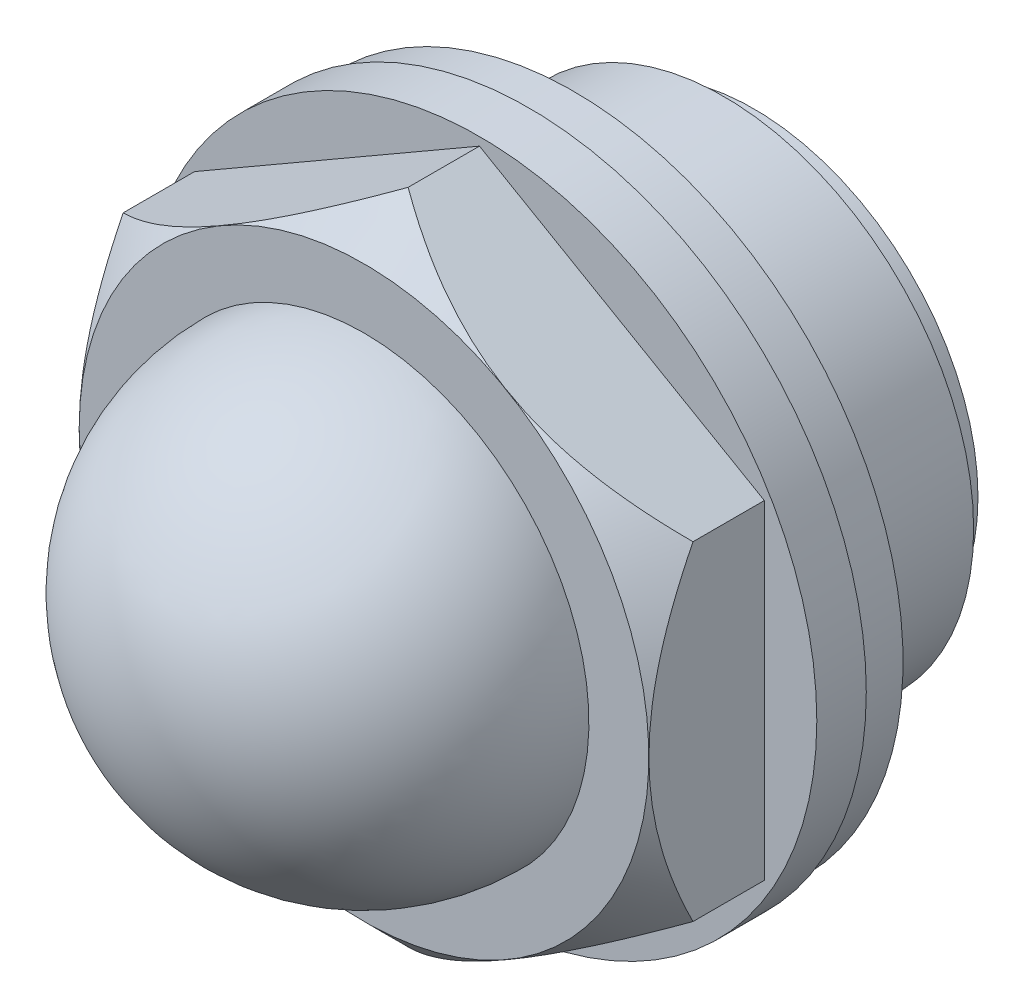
ISO-10303-21;
HEADER;
FILE_DESCRIPTION(('STEP AP214'),'2;1');
FILE_NAME('part.step','',(''),(''),'','','');
FILE_SCHEMA(('AUTOMOTIVE_DESIGN { 1 0 10303 214 1 1 1 1 }'));
ENDSEC;
DATA;
#1=APPLICATION_CONTEXT('core data for automotive mechanical design processes');
#2=APPLICATION_PROTOCOL_DEFINITION('international standard','automotive_design',2000,#1);
#3=PRODUCT_CONTEXT('',#1,'mechanical');
#4=PRODUCT('Part','Part','',(#3));
#5=PRODUCT_RELATED_PRODUCT_CATEGORY('part','',(#4));
#6=PRODUCT_DEFINITION_FORMATION('','',#4);
#7=PRODUCT_DEFINITION_CONTEXT('part definition',#1,'design');
#8=PRODUCT_DEFINITION('design','',#6,#7);
#9=PRODUCT_DEFINITION_SHAPE('','',#8);
#10=(LENGTH_UNIT() NAMED_UNIT(*) SI_UNIT(.MILLI.,.METRE.));
#11=(NAMED_UNIT(*) PLANE_ANGLE_UNIT() SI_UNIT($,.RADIAN.));
#12=(NAMED_UNIT(*) SI_UNIT($,.STERADIAN.) SOLID_ANGLE_UNIT());
#13=UNCERTAINTY_MEASURE_WITH_UNIT(LENGTH_MEASURE(1.E-05),#10,'distance_accuracy_value','');
#14=(GEOMETRIC_REPRESENTATION_CONTEXT(3) GLOBAL_UNCERTAINTY_ASSIGNED_CONTEXT((#13)) GLOBAL_UNIT_ASSIGNED_CONTEXT((#10,
#11,#12)) REPRESENTATION_CONTEXT('',''));
#15=CARTESIAN_POINT('',(0.,0.,0.));
#16=DIRECTION('',(0.,0.,1.));
#17=DIRECTION('',(1.,0.,0.));
#18=AXIS2_PLACEMENT_3D('',#15,#16,#17);
#19=CARTESIAN_POINT('',(0.,0.,14.5));
#20=DIRECTION('',(0.,0.,-1.));
#21=DIRECTION('',(-1.,0.,0.));
#22=AXIS2_PLACEMENT_3D('',#19,#20,#21);
#23=CYLINDRICAL_SURFACE('',#22,8.33);
#24=CARTESIAN_POINT('',(0.,0.,-5.));
#25=DIRECTION('',(0.,0.,-1.));
#26=DIRECTION('',(-1.,0.,0.));
#27=AXIS2_PLACEMENT_3D('',#24,#25,#26);
#28=CIRCLE('',#27,8.33);
#29=CARTESIAN_POINT('',(-8.33,0.,-5.));
#30=VERTEX_POINT('',#29);
#31=EDGE_CURVE('E196',#30,#30,#28,.T.);
#32=ORIENTED_EDGE('',*,*,#31,.F.);
#33=EDGE_LOOP('',(#32));
#34=FACE_BOUND('',#33,.T.);
#35=CARTESIAN_POINT('',(0.,0.,0.));
#36=DIRECTION('',(0.,0.,1.));
#37=DIRECTION('',(1.,0.,0.));
#38=AXIS2_PLACEMENT_3D('',#35,#36,#37);
#39=CIRCLE('',#38,8.33);
#40=CARTESIAN_POINT('',(8.33,0.,0.));
#41=VERTEX_POINT('',#40);
#42=EDGE_CURVE('E9',#41,#41,#39,.F.);
#43=ORIENTED_EDGE('',*,*,#42,.T.);
#44=EDGE_LOOP('',(#43));
#45=FACE_BOUND('',#44,.T.);
#46=ADVANCED_FACE('F14',(#34,#45),#23,.T.);
#47=CARTESIAN_POINT('',(0.,7.14706072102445E-13,7.0000000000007));
#48=DIRECTION('',(0.,0.,-1.));
#49=DIRECTION('',(0.,1.,0.));
#50=AXIS2_PLACEMENT_3D('',#47,#48,#49);
#51=SPHERICAL_SURFACE('',#50,5.9999999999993);
#52=CARTESIAN_POINT('',(0.,0.,7.361437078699));
#53=DIRECTION('',(0.,0.,-1.));
#54=DIRECTION('',(-1.,0.,0.));
#55=AXIS2_PLACEMENT_3D('',#52,#53,#54);
#56=CIRCLE('',#55,5.9891037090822);
#57=CARTESIAN_POINT('',(-5.9891037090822,0.,7.361437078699));
#58=VERTEX_POINT('',#57);
#59=EDGE_CURVE('E229',#58,#58,#56,.T.);
#60=ORIENTED_EDGE('',*,*,#59,.T.);
#61=EDGE_LOOP('',(#60));
#62=FACE_BOUND('',#61,.T.);
#63=ADVANCED_FACE('F16',(#62),#51,.F.);
#64=CARTESIAN_POINT('',(0.,0.,7.361437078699));
#65=DIRECTION('',(0.,0.,-1.));
#66=DIRECTION('',(-1.,0.,0.));
#67=AXIS2_PLACEMENT_3D('',#64,#65,#66);
#68=CONICAL_SURFACE('',#67,5.9891037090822,0.0602760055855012);
#69=CARTESIAN_POINT('',(0.,0.,-6.));
#70=DIRECTION('',(0.,0.,-1.));
#71=DIRECTION('',(-1.,0.,0.));
#72=AXIS2_PLACEMENT_3D('',#69,#70,#71);
#73=CIRCLE('',#72,6.7954545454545);
#74=CARTESIAN_POINT('',(-6.7954545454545,0.,-6.));
#75=VERTEX_POINT('',#74);
#76=EDGE_CURVE('E231',#75,#75,#73,.T.);
#77=ORIENTED_EDGE('',*,*,#76,.T.);
#78=EDGE_LOOP('',(#77));
#79=FACE_BOUND('',#78,.T.);
#80=ORIENTED_EDGE('',*,*,#59,.F.);
#81=EDGE_LOOP('',(#80));
#82=FACE_BOUND('',#81,.T.);
#83=ADVANCED_FACE('F191',(#79,#82),#68,.F.);
#84=CARTESIAN_POINT('',(0.,6.7954545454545,-6.));
#85=DIRECTION('',(0.,0.,-1.));
#86=DIRECTION('',(-1.,0.,0.));
#87=AXIS2_PLACEMENT_3D('',#84,#85,#86);
#88=PLANE('',#87);
#89=CARTESIAN_POINT('',(0.,0.,-6.));
#90=DIRECTION('',(0.,0.,-1.));
#91=DIRECTION('',(-1.,0.,0.));
#92=AXIS2_PLACEMENT_3D('',#89,#90,#91);
#93=CIRCLE('',#92,7.475);
#94=CARTESIAN_POINT('',(-7.475,0.,-6.));
#95=VERTEX_POINT('',#94);
#96=EDGE_CURVE('E234',#95,#95,#93,.T.);
#97=ORIENTED_EDGE('',*,*,#96,.T.);
#98=EDGE_LOOP('',(#97));
#99=FACE_BOUND('',#98,.T.);
#100=ORIENTED_EDGE('',*,*,#76,.F.);
#101=EDGE_LOOP('',(#100));
#102=FACE_BOUND('',#101,.T.);
#103=ADVANCED_FACE('F260',(#99,#102),#88,.T.);
#104=CARTESIAN_POINT('',(0.,0.,14.5));
#105=DIRECTION('',(0.,0.,-1.));
#106=DIRECTION('',(-1.,0.,0.));
#107=AXIS2_PLACEMENT_3D('',#104,#105,#106);
#108=CYLINDRICAL_SURFACE('',#107,7.475);
#109=CARTESIAN_POINT('',(0.,0.,-5.));
#110=DIRECTION('',(0.,0.,-1.));
#111=DIRECTION('',(-1.,0.,0.));
#112=AXIS2_PLACEMENT_3D('',#109,#110,#111);
#113=CIRCLE('',#112,7.475);
#114=CARTESIAN_POINT('',(-7.475,0.,-5.));
#115=VERTEX_POINT('',#114);
#116=EDGE_CURVE('E239',#115,#115,#113,.T.);
#117=ORIENTED_EDGE('',*,*,#116,.T.);
#118=EDGE_LOOP('',(#117));
#119=FACE_BOUND('',#118,.T.);
#120=ORIENTED_EDGE('',*,*,#96,.F.);
#121=EDGE_LOOP('',(#120));
#122=FACE_BOUND('',#121,.T.);
#123=ADVANCED_FACE('F255',(#119,#122),#108,.T.);
#124=CARTESIAN_POINT('',(0.,7.475,-5.));
#125=DIRECTION('',(0.,0.,-1.));
#126=DIRECTION('',(-1.,0.,0.));
#127=AXIS2_PLACEMENT_3D('',#124,#125,#126);
#128=PLANE('',#127);
#129=ORIENTED_EDGE('',*,*,#31,.T.);
#130=EDGE_LOOP('',(#129));
#131=FACE_BOUND('',#130,.T.);
#132=ORIENTED_EDGE('',*,*,#116,.F.);
#133=EDGE_LOOP('',(#132));
#134=FACE_BOUND('',#133,.T.);
#135=ADVANCED_FACE('F252',(#131,#134),#128,.T.);
#136=CARTESIAN_POINT('',(0.,7.3816799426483,3.15));
#137=DIRECTION('',(0.,0.,-1.));
#138=DIRECTION('',(-1.,0.,0.));
#139=AXIS2_PLACEMENT_3D('',#136,#137,#138);
#140=PLANE('',#139);
#141=CARTESIAN_POINT('',(0.,0.,3.15));
#142=DIRECTION('',(0.,0.,-1.));
#143=DIRECTION('',(-1.,0.,0.));
#144=AXIS2_PLACEMENT_3D('',#141,#142,#143);
#145=CIRCLE('',#144,11.25);
#146=CARTESIAN_POINT('',(-11.25,0.,3.15));
#147=VERTEX_POINT('',#146);
#148=EDGE_CURVE('E208',#147,#147,#145,.T.);
#149=ORIENTED_EDGE('',*,*,#148,.F.);
#150=EDGE_LOOP('',(#149));
#151=FACE_BOUND('',#150,.T.);
#152=DIRECTION('',(-0.866025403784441,-0.5,0.));
#153=VECTOR('',#152,1.);
#154=CARTESIAN_POINT('',(9.5,-5.4848275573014,3.15));
#155=LINE('',#154,#153);
#156=CARTESIAN_POINT('',(9.5,-5.4848275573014,3.15));
#157=VERTEX_POINT('',#156);
#158=CARTESIAN_POINT('',(0.,-10.9696551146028,3.15));
#159=VERTEX_POINT('',#158);
#160=EDGE_CURVE('E82',#157,#159,#155,.T.);
#161=ORIENTED_EDGE('',*,*,#160,.T.);
#162=DIRECTION('',(-0.866025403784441,0.5,0.));
#163=VECTOR('',#162,1.);
#164=CARTESIAN_POINT('',(13.908965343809,-19.,3.15));
#165=LINE('',#164,#163);
#166=CARTESIAN_POINT('',(-9.5,-5.4848275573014,3.15));
#167=VERTEX_POINT('',#166);
#168=EDGE_CURVE('E78',#159,#167,#165,.T.);
#169=ORIENTED_EDGE('',*,*,#168,.T.);
#170=DIRECTION('',(0.,1.,0.));
#171=VECTOR('',#170,1.);
#172=CARTESIAN_POINT('',(-9.5,-5.4848275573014,3.15));
#173=LINE('',#172,#171);
#174=CARTESIAN_POINT('',(-9.5,5.4848275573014,3.15));
#175=VERTEX_POINT('',#174);
#176=EDGE_CURVE('E29',#167,#175,#173,.T.);
#177=ORIENTED_EDGE('',*,*,#176,.T.);
#178=DIRECTION('',(0.866025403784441,0.5,0.));
#179=VECTOR('',#178,1.);
#180=CARTESIAN_POINT('',(-9.5,5.4848275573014,3.15));
#181=LINE('',#180,#179);
#182=CARTESIAN_POINT('',(0.,10.9696551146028,3.15));
#183=VERTEX_POINT('',#182);
#184=EDGE_CURVE('E37',#175,#183,#181,.T.);
#185=ORIENTED_EDGE('',*,*,#184,.T.);
#186=DIRECTION('',(0.866025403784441,-0.5,0.));
#187=VECTOR('',#186,1.);
#188=CARTESIAN_POINT('',(-13.908965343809,19.,3.15));
#189=LINE('',#188,#187);
#190=CARTESIAN_POINT('',(9.5,5.4848275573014,3.15));
#191=VERTEX_POINT('',#190);
#192=EDGE_CURVE('E87',#183,#191,#189,.T.);
#193=ORIENTED_EDGE('',*,*,#192,.T.);
#194=DIRECTION('',(0.,-1.,0.));
#195=VECTOR('',#194,1.);
#196=CARTESIAN_POINT('',(9.5,5.4848275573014,3.15));
#197=LINE('',#196,#195);
#198=EDGE_CURVE('E22',#191,#157,#197,.T.);
#199=ORIENTED_EDGE('',*,*,#198,.T.);
#200=EDGE_LOOP('',(#161,#169,#177,#185,#193,#199));
#201=FACE_BOUND('',#200,.T.);
#202=ADVANCED_FACE('F90',(#151,#201),#140,.F.);
#203=CARTESIAN_POINT('',(0.,0.,14.5));
#204=DIRECTION('',(0.,0.,-1.));
#205=DIRECTION('',(-1.,0.,0.));
#206=AXIS2_PLACEMENT_3D('',#203,#204,#205);
#207=CYLINDRICAL_SURFACE('',#206,10.975609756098);
#208=CARTESIAN_POINT('',(0.,0.,0.));
#209=DIRECTION('',(0.,0.,-1.));
#210=DIRECTION('',(-1.,0.,0.));
#211=AXIS2_PLACEMENT_3D('',#208,#209,#210);
#212=CIRCLE('',#211,10.975609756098);
#213=CARTESIAN_POINT('',(-10.975609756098,0.,0.));
#214=VERTEX_POINT('',#213);
#215=EDGE_CURVE('E206',#214,#214,#212,.T.);
#216=ORIENTED_EDGE('',*,*,#215,.F.);
#217=EDGE_LOOP('',(#216));
#218=FACE_BOUND('',#217,.T.);
#219=CARTESIAN_POINT('',(0.,0.,1.5));
#220=DIRECTION('',(0.,0.,-1.));
#221=DIRECTION('',(-1.,0.,0.));
#222=AXIS2_PLACEMENT_3D('',#219,#220,#221);
#223=CIRCLE('',#222,10.975609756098);
#224=CARTESIAN_POINT('',(-10.975609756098,0.,1.5));
#225=VERTEX_POINT('',#224);
#226=EDGE_CURVE('E596',#225,#225,#223,.T.);
#227=ORIENTED_EDGE('',*,*,#226,.T.);
#228=EDGE_LOOP('',(#227));
#229=FACE_BOUND('',#228,.T.);
#230=ADVANCED_FACE('F202',(#218,#229),#207,.T.);
#231=CARTESIAN_POINT('',(0.,10.975609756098,0.));
#232=DIRECTION('',(0.,0.,1.));
#233=DIRECTION('',(1.,0.,0.));
#234=AXIS2_PLACEMENT_3D('',#231,#232,#233);
#235=PLANE('',#234);
#236=ORIENTED_EDGE('',*,*,#42,.F.);
#237=EDGE_LOOP('',(#236));
#238=FACE_BOUND('',#237,.T.);
#239=ORIENTED_EDGE('',*,*,#215,.T.);
#240=EDGE_LOOP('',(#239));
#241=FACE_BOUND('',#240,.T.);
#242=ADVANCED_FACE('F199',(#238,#241),#235,.F.);
#243=CARTESIAN_POINT('',(0.,0.,14.5));
#244=DIRECTION('',(0.,0.,-1.));
#245=DIRECTION('',(-1.,0.,0.));
#246=AXIS2_PLACEMENT_3D('',#243,#244,#245);
#247=CYLINDRICAL_SURFACE('',#246,11.25);
#248=CARTESIAN_POINT('',(0.,0.,1.5));
#249=DIRECTION('',(0.,0.,-1.));
#250=DIRECTION('',(-1.,0.,0.));
#251=AXIS2_PLACEMENT_3D('',#248,#249,#250);
#252=CIRCLE('',#251,11.25);
#253=CARTESIAN_POINT('',(-11.25,0.,1.5));
#254=VERTEX_POINT('',#253);
#255=EDGE_CURVE('E212',#254,#254,#252,.T.);
#256=ORIENTED_EDGE('',*,*,#255,.F.);
#257=EDGE_LOOP('',(#256));
#258=FACE_BOUND('',#257,.T.);
#259=ORIENTED_EDGE('',*,*,#148,.T.);
#260=EDGE_LOOP('',(#259));
#261=FACE_BOUND('',#260,.T.);
#262=ADVANCED_FACE('F181',(#258,#261),#247,.T.);
#263=CARTESIAN_POINT('',(0.,11.25,1.5));
#264=DIRECTION('',(0.,0.,1.));
#265=DIRECTION('',(1.,0.,0.));
#266=AXIS2_PLACEMENT_3D('',#263,#264,#265);
#267=PLANE('',#266);
#268=ORIENTED_EDGE('',*,*,#226,.F.);
#269=EDGE_LOOP('',(#268));
#270=FACE_BOUND('',#269,.T.);
#271=ORIENTED_EDGE('',*,*,#255,.T.);
#272=EDGE_LOOP('',(#271));
#273=FACE_BOUND('',#272,.T.);
#274=ADVANCED_FACE('F172',(#270,#273),#267,.F.);
#275=CARTESIAN_POINT('',(0.,-1.91253263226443E-13,6.9999999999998));
#276=DIRECTION('',(0.,0.,-1.));
#277=DIRECTION('',(0.,1.,0.));
#278=AXIS2_PLACEMENT_3D('',#275,#276,#277);
#279=SPHERICAL_SURFACE('',#278,7.50000000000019);
#280=CARTESIAN_POINT('',(0.,0.,7.));
#281=DIRECTION('',(0.,0.,-1.));
#282=DIRECTION('',(-1.,0.,0.));
#283=AXIS2_PLACEMENT_3D('',#280,#281,#282);
#284=CIRCLE('',#283,7.5);
#285=CARTESIAN_POINT('',(-7.5,0.,7.));
#286=VERTEX_POINT('',#285);
#287=EDGE_CURVE('E246',#286,#286,#284,.T.);
#288=ORIENTED_EDGE('',*,*,#287,.F.);
#289=EDGE_LOOP('',(#288));
#290=FACE_BOUND('',#289,.T.);
#291=ADVANCED_FACE('F170',(#290),#279,.T.);
#292=CARTESIAN_POINT('',(0.,9.499,7.));
#293=DIRECTION('',(0.,0.,1.));
#294=DIRECTION('',(1.,0.,0.));
#295=AXIS2_PLACEMENT_3D('',#292,#293,#294);
#296=PLANE('',#295);
#297=ORIENTED_EDGE('',*,*,#287,.T.);
#298=EDGE_LOOP('',(#297));
#299=FACE_BOUND('',#298,.T.);
#300=CARTESIAN_POINT('',(0.,0.,7.));
#301=DIRECTION('',(0.,0.,-1.));
#302=DIRECTION('',(-1.,0.,0.));
#303=AXIS2_PLACEMENT_3D('',#300,#301,#302);
#304=CIRCLE('',#303,9.499);
#305=CARTESIAN_POINT('',(-9.499,0.,7.));
#306=VERTEX_POINT('',#305);
#307=EDGE_CURVE('E243',#306,#306,#304,.T.);
#308=ORIENTED_EDGE('',*,*,#307,.F.);
#309=EDGE_LOOP('',(#308));
#310=FACE_BOUND('',#309,.T.);
#311=ADVANCED_FACE('F108',(#299,#310),#296,.T.);
#312=CARTESIAN_POINT('',(0.,0.,5.249));
#313=DIRECTION('',(0.,0.,-1.));
#314=DIRECTION('',(-1.,0.,0.));
#315=AXIS2_PLACEMENT_3D('',#312,#313,#314);
#316=CONICAL_SURFACE('',#315,11.25,0.785398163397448);
#317=CARTESIAN_POINT('',(9.5002,-5.48471208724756,5.5292294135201));
#318=CARTESIAN_POINT('',(9.3366791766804,-5.57912087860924,5.62362483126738));
#319=CARTESIAN_POINT('',(9.17187614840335,-5.67426995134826,5.71513650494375));
#320=CARTESIAN_POINT('',(8.83950563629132,-5.86616415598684,5.89147520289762));
#321=CARTESIAN_POINT('',(8.67193669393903,-5.96291012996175,5.97629855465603));
#322=CARTESIAN_POINT('',(8.33304658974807,-6.1585684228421,6.13870122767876));
#323=CARTESIAN_POINT('',(8.16170945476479,-6.25748996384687,6.21623636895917));
#324=CARTESIAN_POINT('',(7.81621809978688,-6.45695949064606,6.36237593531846));
#325=CARTESIAN_POINT('',(7.64206431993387,-6.55750722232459,6.4309817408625));
#326=CARTESIAN_POINT('',(7.29415157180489,-6.75837474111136,6.55693966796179));
#327=CARTESIAN_POINT('',(7.12044180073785,-6.85866612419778,6.61447194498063));
#328=CARTESIAN_POINT('',(6.7705913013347,-7.06065240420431,6.71862965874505));
#329=CARTESIAN_POINT('',(6.59445083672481,-7.16234714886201,6.76525626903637));
#330=CARTESIAN_POINT('',(6.24049080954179,-7.3667060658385,6.84643118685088));
#331=CARTESIAN_POINT('',(6.06267595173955,-7.46936752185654,6.88100660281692));
#332=CARTESIAN_POINT('',(5.70555594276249,-7.67555085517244,6.93732096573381));
#333=CARTESIAN_POINT('',(5.52625101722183,-7.77907260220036,6.95906182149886));
#334=CARTESIAN_POINT('',(5.08914845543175,-8.03143388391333,6.99554144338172));
#335=CARTESIAN_POINT('',(4.83087795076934,-8.18054642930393,7.00320692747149));
#336=CARTESIAN_POINT('',(4.3148046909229,-8.47850146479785,6.99038864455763));
#337=CARTESIAN_POINT('',(4.05700212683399,-8.62734384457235,6.9698952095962));
#338=CARTESIAN_POINT('',(3.54351262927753,-8.92380714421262,6.90192574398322));
#339=CARTESIAN_POINT('',(3.28783199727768,-9.07142442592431,6.85438717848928));
#340=CARTESIAN_POINT('',(2.78086867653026,-9.36411983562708,6.73489261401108));
#341=CARTESIAN_POINT('',(2.52958574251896,-9.50919810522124,6.66293798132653));
#342=CARTESIAN_POINT('',(2.04118470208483,-9.79117657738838,6.50084121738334));
#343=CARTESIAN_POINT('',(1.80388054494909,-9.92818419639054,6.41143619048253));
#344=CARTESIAN_POINT('',(1.33443818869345,-10.1992168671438,6.21596445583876));
#345=CARTESIAN_POINT('',(1.1023016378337,-10.3332409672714,6.1098925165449));
#346=CARTESIAN_POINT('',(0.64408551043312,-10.5977921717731,5.88434552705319));
#347=CARTESIAN_POINT('',(0.417985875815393,-10.7283308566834,5.76492425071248));
#348=CARTESIAN_POINT('',(-0.0291395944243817,-10.9864788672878,5.51478479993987));
#349=CARTESIAN_POINT('',(-0.250171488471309,-11.1140916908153,5.38408111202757));
#350=CARTESIAN_POINT('',(-0.468979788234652,-11.2404207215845,5.2488));
#351=B_SPLINE_CURVE_WITH_KNOTS('',3,(#317,#318,#319,#320,#321,#322,#323,#324,#325,#326,#327,
#328,#329,#330,#331,#332,#333,#334,#335,#336,#337,#338,#339,#340,#341,#342,#343,#344,#345,#346,
#347,#348,#349,#350),.UNSPECIFIED.,.F.,.F.,(4,2,2,2,2,2,2,2,2,2,2,2,2,2,2,2,4),(0.,
0.633322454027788,1.26699027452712,1.90428027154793,2.54147162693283,3.16720677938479,
3.79287456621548,4.4171257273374,5.04128402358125,5.93486112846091,6.82874510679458,
7.72470440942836,8.62061358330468,9.48468847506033,10.3490351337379,11.2100176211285,
12.0699106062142),.UNSPECIFIED.);
#352=CARTESIAN_POINT('',(9.5,-5.4848275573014,5.52934488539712));
#353=VERTEX_POINT('',#352);
#354=CARTESIAN_POINT('',(0.,-10.9696551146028,5.52934488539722));
#355=VERTEX_POINT('',#354);
#356=EDGE_CURVE('E147',#353,#355,#351,.T.);
#357=ORIENTED_EDGE('',*,*,#356,.F.);
#358=CARTESIAN_POINT('',(9.5,-11.5594634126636,1.53667416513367));
#359=CARTESIAN_POINT('',(9.5,-11.2806225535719,1.75205038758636));
#360=CARTESIAN_POINT('',(9.5,-11.0002921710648,1.96552824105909));
#361=CARTESIAN_POINT('',(9.5,-10.4360389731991,2.38781618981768));
#362=CARTESIAN_POINT('',(9.5,-10.1521153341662,2.59662518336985));
#363=CARTESIAN_POINT('',(9.5,-9.57798890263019,3.01018988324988));
#364=CARTESIAN_POINT('',(9.5,-9.28775458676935,3.21490196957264));
#365=CARTESIAN_POINT('',(9.5,-8.70247807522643,3.61730984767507));
#366=CARTESIAN_POINT('',(9.5,-8.40743621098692,3.81500612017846));
#367=CARTESIAN_POINT('',(9.5,-7.79241989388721,4.21431114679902));
#368=CARTESIAN_POINT('',(9.5,-7.47206893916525,4.41534290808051));
#369=CARTESIAN_POINT('',(9.5,-6.82383713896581,4.80508508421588));
#370=CARTESIAN_POINT('',(9.5,-6.49595502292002,4.99379339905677));
#371=CARTESIAN_POINT('',(9.5,-5.83254499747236,5.35488183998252));
#372=CARTESIAN_POINT('',(9.5,-5.49704336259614,5.52730986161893));
#373=CARTESIAN_POINT('',(9.5,-4.81648567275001,5.85197414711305));
#374=CARTESIAN_POINT('',(9.5,-4.47143425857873,6.00422001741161));
#375=CARTESIAN_POINT('',(9.5,-3.80685063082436,6.26870096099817));
#376=CARTESIAN_POINT('',(9.5,-3.48832382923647,6.38343681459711));
#377=CARTESIAN_POINT('',(9.5,-2.84305846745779,6.58742155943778));
#378=CARTESIAN_POINT('',(9.5,-2.51631939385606,6.67666885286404));
#379=CARTESIAN_POINT('',(9.5,-1.86233019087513,6.82331770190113));
#380=CARTESIAN_POINT('',(9.5,-1.53521367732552,6.88130504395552));
#381=CARTESIAN_POINT('',(9.5,-0.876792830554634,6.96420751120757));
#382=CARTESIAN_POINT('',(9.5,-0.545489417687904,6.98912978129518));
#383=CARTESIAN_POINT('',(9.5,0.102815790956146,7.00371996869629));
#384=CARTESIAN_POINT('',(9.5,0.4197829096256,6.99493936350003));
#385=CARTESIAN_POINT('',(9.5,1.05129393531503,6.94619659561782));
#386=CARTESIAN_POINT('',(9.5,1.36583762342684,6.9062316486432));
#387=CARTESIAN_POINT('',(9.5,1.99556022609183,6.79671819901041));
#388=CARTESIAN_POINT('',(9.5,2.31064598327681,6.72664313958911));
#389=CARTESIAN_POINT('',(9.5,2.93386009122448,6.56083063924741));
#390=CARTESIAN_POINT('',(9.5,3.24198879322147,6.46509449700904));
#391=CARTESIAN_POINT('',(9.5,3.86608169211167,6.24684006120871));
#392=CARTESIAN_POINT('',(9.5,4.18165302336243,6.12321140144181));
#393=CARTESIAN_POINT('',(9.5,4.80469185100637,5.85683450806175));
#394=CARTESIAN_POINT('',(9.5,5.11215564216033,5.71407770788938));
#395=CARTESIAN_POINT('',(9.5,5.72042239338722,5.41282844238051));
#396=CARTESIAN_POINT('',(9.5,6.02120124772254,5.25428769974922));
#397=CARTESIAN_POINT('',(9.5,6.6158717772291,4.92495653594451));
#398=CARTESIAN_POINT('',(9.5,6.9097644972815,4.75416798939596));
#399=CARTESIAN_POINT('',(9.5,7.47721105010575,4.41139754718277));
#400=CARTESIAN_POINT('',(9.5,7.75105302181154,4.23989013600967));
#401=CARTESIAN_POINT('',(9.5,8.29403169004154,3.88956058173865));
#402=CARTESIAN_POINT('',(9.5,8.56316803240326,3.71073789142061));
#403=CARTESIAN_POINT('',(9.5,9.09519086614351,3.34853358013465));
#404=CARTESIAN_POINT('',(9.5,9.35811015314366,3.16519995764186));
#405=CARTESIAN_POINT('',(9.5,9.88033963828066,2.79360718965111));
#406=CARTESIAN_POINT('',(9.5,10.1396508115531,2.60534941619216));
#407=CARTESIAN_POINT('',(9.5,10.397447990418,2.41507566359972));
#408=B_SPLINE_CURVE_WITH_KNOTS('',3,(#358,#359,#360,#361,#362,#363,#364,#365,#366,#367,#368,
#369,#370,#371,#372,#373,#374,#375,#376,#377,#378,#379,#380,#381,#382,#383,#384,#385,#386,#387,
#388,#389,#390,#391,#392,#393,#394,#395,#396,#397,#398,#399,#400,#401,#402,#403,#404,#405,#406,
#407),.UNSPECIFIED.,.F.,.F.,(4,2,2,2,2,2,2,2,2,2,2,2,2,2,2,2,2,2,2,2,2,2,2,2,4),(0.,
1.05702061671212,2.114288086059,3.17970079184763,4.24504035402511,5.37943291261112,
6.51401827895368,7.64515436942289,8.77575010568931,9.79056152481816,10.805436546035,
11.8005669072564,12.7954821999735,13.7451590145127,14.694920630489,15.6620143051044,
16.6290590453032,17.6450536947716,18.6615048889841,19.6811665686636,20.7006725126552,
21.6698855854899,22.6391712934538,23.6006919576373,24.5619475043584),.UNSPECIFIED.);
#409=CARTESIAN_POINT('',(9.5,5.4848275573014,5.52934488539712));
#410=VERTEX_POINT('',#409);
#411=EDGE_CURVE('E73',#410,#353,#408,.F.);
#412=ORIENTED_EDGE('',*,*,#411,.F.);
#413=CARTESIAN_POINT('',(-0.46897978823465,11.2404207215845,5.2488));
#414=CARTESIAN_POINT('',(-0.324026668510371,11.1567319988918,5.33844670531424));
#415=CARTESIAN_POINT('',(-0.178109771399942,11.0724868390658,5.4260492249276));
#416=CARTESIAN_POINT('',(0.115810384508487,10.9027919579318,5.59658367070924));
#417=CARTESIAN_POINT('',(0.263814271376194,10.8173418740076,5.67951415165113));
#418=CARTESIAN_POINT('',(0.562621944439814,10.6448251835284,5.8404130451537));
#419=CARTESIAN_POINT('',(0.713435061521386,10.557753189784,5.91835848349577));
#420=CARTESIAN_POINT('',(1.01728930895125,10.382322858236,6.06816389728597));
#421=CARTESIAN_POINT('',(1.17033025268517,10.2939646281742,6.14002437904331));
#422=CARTESIAN_POINT('',(1.63170369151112,10.0275905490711,6.34479989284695));
#423=CARTESIAN_POINT('',(1.94350383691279,9.84757265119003,6.46757699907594));
#424=CARTESIAN_POINT('',(2.5752070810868,9.48285861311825,6.67886589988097));
#425=CARTESIAN_POINT('',(2.89509271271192,9.29817255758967,6.76744578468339));
#426=CARTESIAN_POINT('',(3.46088746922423,8.97151080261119,6.88704024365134));
#427=CARTESIAN_POINT('',(3.70539366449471,8.83034508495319,6.92689493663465));
#428=CARTESIAN_POINT('',(4.1965623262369,8.54676872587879,6.98171028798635));
#429=CARTESIAN_POINT('',(4.44322502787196,8.40435794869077,6.99666819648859));
#430=CARTESIAN_POINT('',(4.93646277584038,8.11958700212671,7.00082391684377));
#431=CARTESIAN_POINT('',(5.18303765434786,7.977226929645,6.99004802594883));
#432=CARTESIAN_POINT('',(5.67433858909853,7.69357420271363,6.94341350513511));
#433=CARTESIAN_POINT('',(5.91906483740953,7.55228143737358,6.90755751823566));
#434=CARTESIAN_POINT('',(6.45239051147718,7.2443657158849,6.80337978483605));
#435=CARTESIAN_POINT('',(6.74026015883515,7.07816409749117,6.73009806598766));
#436=CARTESIAN_POINT('',(7.30959613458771,6.74945781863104,6.55492171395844));
#437=CARTESIAN_POINT('',(7.59105490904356,6.5869575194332,6.45299504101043));
#438=CARTESIAN_POINT('',(8.14843336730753,6.26515491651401,6.22486025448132));
#439=CARTESIAN_POINT('',(8.42430634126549,6.10587958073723,6.09850159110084));
#440=CARTESIAN_POINT('',(8.83224174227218,5.87035796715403,5.8947725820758));
#441=CARTESIAN_POINT('',(8.96705860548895,5.79252141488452,5.82460465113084));
#442=CARTESIAN_POINT('',(9.23492388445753,5.63786932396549,5.68000103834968));
#443=CARTESIAN_POINT('',(9.36797275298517,5.56105352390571,5.60556647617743));
#444=CARTESIAN_POINT('',(9.5002,5.48471208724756,5.5292294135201));
#445=B_SPLINE_CURVE_WITH_KNOTS('',3,(#413,#414,#415,#416,#417,#418,#419,#420,#421,#422,#423,
#424,#425,#426,#427,#428,#429,#430,#431,#432,#433,#434,#435,#436,#437,#438,#439,#440,#441,#442,
#443,#444),.UNSPECIFIED.,.F.,.F.,(4,2,2,2,2,2,2,2,2,2,2,2,2,2,2,4),(0.,0.569627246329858,
1.13942974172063,1.71169282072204,2.28390823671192,3.42368220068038,4.56117490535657,
5.41556728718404,6.2700540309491,7.12366795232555,7.97719193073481,8.99681036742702,
10.0175738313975,11.0448401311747,11.5570570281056,12.069140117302),.UNSPECIFIED.);
#446=CARTESIAN_POINT('',(0.,10.9696551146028,5.52934488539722));
#447=VERTEX_POINT('',#446);
#448=EDGE_CURVE('E140',#447,#410,#445,.T.);
#449=ORIENTED_EDGE('',*,*,#448,.F.);
#450=CARTESIAN_POINT('',(-9.5002,5.48471208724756,5.5292294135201));
#451=CARTESIAN_POINT('',(-9.3366791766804,5.57912087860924,5.62362483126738));
#452=CARTESIAN_POINT('',(-9.17187614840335,5.67426995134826,5.71513650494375));
#453=CARTESIAN_POINT('',(-8.83950563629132,5.86616415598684,5.89147520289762));
#454=CARTESIAN_POINT('',(-8.67193669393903,5.96291012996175,5.97629855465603));
#455=CARTESIAN_POINT('',(-8.33304658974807,6.1585684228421,6.13870122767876));
#456=CARTESIAN_POINT('',(-8.16170945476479,6.25748996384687,6.21623636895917));
#457=CARTESIAN_POINT('',(-7.81621809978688,6.45695949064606,6.36237593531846));
#458=CARTESIAN_POINT('',(-7.64206431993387,6.55750722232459,6.4309817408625));
#459=CARTESIAN_POINT('',(-7.29415157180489,6.75837474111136,6.55693966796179));
#460=CARTESIAN_POINT('',(-7.12044180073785,6.85866612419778,6.61447194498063));
#461=CARTESIAN_POINT('',(-6.7705913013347,7.06065240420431,6.71862965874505));
#462=CARTESIAN_POINT('',(-6.59445083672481,7.16234714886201,6.76525626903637));
#463=CARTESIAN_POINT('',(-6.24049080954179,7.3667060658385,6.84643118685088));
#464=CARTESIAN_POINT('',(-6.06267595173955,7.46936752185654,6.88100660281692));
#465=CARTESIAN_POINT('',(-5.70555594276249,7.67555085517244,6.93732096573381));
#466=CARTESIAN_POINT('',(-5.52625101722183,7.77907260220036,6.95906182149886));
#467=CARTESIAN_POINT('',(-5.08914845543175,8.03143388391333,6.99554144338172));
#468=CARTESIAN_POINT('',(-4.83087795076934,8.18054642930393,7.00320692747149));
#469=CARTESIAN_POINT('',(-4.3148046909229,8.47850146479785,6.99038864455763));
#470=CARTESIAN_POINT('',(-4.05700212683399,8.62734384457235,6.9698952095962));
#471=CARTESIAN_POINT('',(-3.54351262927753,8.92380714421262,6.90192574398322));
#472=CARTESIAN_POINT('',(-3.28783199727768,9.07142442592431,6.85438717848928));
#473=CARTESIAN_POINT('',(-2.78086867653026,9.36411983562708,6.73489261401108));
#474=CARTESIAN_POINT('',(-2.52958574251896,9.50919810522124,6.66293798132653));
#475=CARTESIAN_POINT('',(-2.04118470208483,9.79117657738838,6.50084121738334));
#476=CARTESIAN_POINT('',(-1.80388054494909,9.92818419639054,6.41143619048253));
#477=CARTESIAN_POINT('',(-1.33443818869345,10.1992168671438,6.21596445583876));
#478=CARTESIAN_POINT('',(-1.1023016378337,10.3332409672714,6.1098925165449));
#479=CARTESIAN_POINT('',(-0.64408551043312,10.5977921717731,5.88434552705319));
#480=CARTESIAN_POINT('',(-0.417985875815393,10.7283308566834,5.76492425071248));
#481=CARTESIAN_POINT('',(0.0291395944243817,10.9864788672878,5.51478479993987));
#482=CARTESIAN_POINT('',(0.250171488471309,11.1140916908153,5.38408111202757));
#483=CARTESIAN_POINT('',(0.468979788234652,11.2404207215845,5.2488));
#484=B_SPLINE_CURVE_WITH_KNOTS('',3,(#450,#451,#452,#453,#454,#455,#456,#457,#458,#459,#460,
#461,#462,#463,#464,#465,#466,#467,#468,#469,#470,#471,#472,#473,#474,#475,#476,#477,#478,#479,
#480,#481,#482,#483),.UNSPECIFIED.,.F.,.F.,(4,2,2,2,2,2,2,2,2,2,2,2,2,2,2,2,4),(0.,
0.633322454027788,1.26699027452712,1.90428027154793,2.54147162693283,3.16720677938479,
3.79287456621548,4.4171257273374,5.04128402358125,5.93486112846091,6.82874510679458,
7.72470440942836,8.62061358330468,9.48468847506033,10.3490351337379,11.2100176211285,
12.0699106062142),.UNSPECIFIED.);
#485=CARTESIAN_POINT('',(-9.5,5.4848275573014,5.52934488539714));
#486=VERTEX_POINT('',#485);
#487=EDGE_CURVE('E115',#486,#447,#484,.T.);
#488=ORIENTED_EDGE('',*,*,#487,.F.);
#489=CARTESIAN_POINT('',(-9.5,-11.5594634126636,1.53667416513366));
#490=CARTESIAN_POINT('',(-9.5,-11.2806225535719,1.75205038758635));
#491=CARTESIAN_POINT('',(-9.5,-11.0002921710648,1.96552824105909));
#492=CARTESIAN_POINT('',(-9.5,-10.4360389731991,2.38781618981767));
#493=CARTESIAN_POINT('',(-9.5,-10.1521153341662,2.59662518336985));
#494=CARTESIAN_POINT('',(-9.5,-9.57798890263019,3.01018988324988));
#495=CARTESIAN_POINT('',(-9.5,-9.28775458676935,3.21490196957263));
#496=CARTESIAN_POINT('',(-9.5,-8.70247807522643,3.61730984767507));
#497=CARTESIAN_POINT('',(-9.5,-8.40743621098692,3.81500612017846));
#498=CARTESIAN_POINT('',(-9.5,-7.79241989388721,4.21431114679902));
#499=CARTESIAN_POINT('',(-9.5,-7.47206893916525,4.41534290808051));
#500=CARTESIAN_POINT('',(-9.5,-6.82383713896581,4.80508508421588));
#501=CARTESIAN_POINT('',(-9.5,-6.49595502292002,4.99379339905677));
#502=CARTESIAN_POINT('',(-9.5,-5.83254499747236,5.35488183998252));
#503=CARTESIAN_POINT('',(-9.5,-5.49704336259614,5.52730986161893));
#504=CARTESIAN_POINT('',(-9.5,-4.81648567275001,5.85197414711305));
#505=CARTESIAN_POINT('',(-9.5,-4.47143425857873,6.00422001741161));
#506=CARTESIAN_POINT('',(-9.5,-3.80685063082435,6.26870096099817));
#507=CARTESIAN_POINT('',(-9.5,-3.48832382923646,6.38343681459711));
#508=CARTESIAN_POINT('',(-9.5,-2.84305846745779,6.58742155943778));
#509=CARTESIAN_POINT('',(-9.5,-2.51631939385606,6.67666885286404));
#510=CARTESIAN_POINT('',(-9.5,-1.86233019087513,6.82331770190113));
#511=CARTESIAN_POINT('',(-9.5,-1.53521367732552,6.88130504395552));
#512=CARTESIAN_POINT('',(-9.5,-0.876792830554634,6.96420751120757));
#513=CARTESIAN_POINT('',(-9.5,-0.545489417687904,6.98912978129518));
#514=CARTESIAN_POINT('',(-9.5,0.102815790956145,7.00371996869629));
#515=CARTESIAN_POINT('',(-9.5,0.419782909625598,6.99493936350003));
#516=CARTESIAN_POINT('',(-9.5,1.05129393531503,6.94619659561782));
#517=CARTESIAN_POINT('',(-9.5,1.36583762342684,6.9062316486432));
#518=CARTESIAN_POINT('',(-9.5,1.99556022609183,6.79671819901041));
#519=CARTESIAN_POINT('',(-9.5,2.3106459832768,6.72664313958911));
#520=CARTESIAN_POINT('',(-9.5,2.93386009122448,6.56083063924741));
#521=CARTESIAN_POINT('',(-9.5,3.24198879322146,6.46509449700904));
#522=CARTESIAN_POINT('',(-9.5,3.86608169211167,6.24684006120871));
#523=CARTESIAN_POINT('',(-9.5,4.18165302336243,6.12321140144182));
#524=CARTESIAN_POINT('',(-9.5,4.80469185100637,5.85683450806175));
#525=CARTESIAN_POINT('',(-9.5,5.11215564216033,5.71407770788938));
#526=CARTESIAN_POINT('',(-9.5,5.72042239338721,5.41282844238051));
#527=CARTESIAN_POINT('',(-9.5,6.02120124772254,5.25428769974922));
#528=CARTESIAN_POINT('',(-9.5,6.6158717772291,4.92495653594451));
#529=CARTESIAN_POINT('',(-9.5,6.9097644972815,4.75416798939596));
#530=CARTESIAN_POINT('',(-9.5,7.47721105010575,4.41139754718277));
#531=CARTESIAN_POINT('',(-9.5,7.75105302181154,4.23989013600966));
#532=CARTESIAN_POINT('',(-9.5,8.29403169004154,3.88956058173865));
#533=CARTESIAN_POINT('',(-9.5,8.56316803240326,3.71073789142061));
#534=CARTESIAN_POINT('',(-9.5,9.09519086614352,3.34853358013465));
#535=CARTESIAN_POINT('',(-9.5,9.35811015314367,3.16519995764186));
#536=CARTESIAN_POINT('',(-9.5,9.88033963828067,2.79360718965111));
#537=CARTESIAN_POINT('',(-9.5,10.1396508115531,2.60534941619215));
#538=CARTESIAN_POINT('',(-9.5,10.397447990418,2.41507566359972));
#539=B_SPLINE_CURVE_WITH_KNOTS('',3,(#489,#490,#491,#492,#493,#494,#495,#496,#497,#498,#499,
#500,#501,#502,#503,#504,#505,#506,#507,#508,#509,#510,#511,#512,#513,#514,#515,#516,#517,#518,
#519,#520,#521,#522,#523,#524,#525,#526,#527,#528,#529,#530,#531,#532,#533,#534,#535,#536,#537,
#538),.UNSPECIFIED.,.F.,.F.,(4,2,2,2,2,2,2,2,2,2,2,2,2,2,2,2,2,2,2,2,2,2,2,2,4),(0.,
1.05702061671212,2.114288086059,3.17970079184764,4.24504035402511,5.37943291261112,
6.51401827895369,7.6451543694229,8.77575010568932,9.79056152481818,10.8054365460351,
11.8005669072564,12.7954821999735,13.7451590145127,14.694920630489,15.6620143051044,
16.6290590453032,17.6450536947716,18.6615048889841,19.6811665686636,20.7006725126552,
21.6698855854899,22.6391712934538,23.6006919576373,24.5619475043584),.UNSPECIFIED.);
#540=CARTESIAN_POINT('',(-9.5,-5.4848275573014,5.52934488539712));
#541=VERTEX_POINT('',#540);
#542=EDGE_CURVE('E125',#541,#486,#539,.T.);
#543=ORIENTED_EDGE('',*,*,#542,.F.);
#544=CARTESIAN_POINT('',(0.468979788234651,-11.2404207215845,5.2488));
#545=CARTESIAN_POINT('',(0.324026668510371,-11.1567319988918,5.33844670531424));
#546=CARTESIAN_POINT('',(0.178109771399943,-11.0724868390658,5.4260492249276));
#547=CARTESIAN_POINT('',(-0.115810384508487,-10.9027919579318,5.59658367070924));
#548=CARTESIAN_POINT('',(-0.263814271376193,-10.8173418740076,5.67951415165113));
#549=CARTESIAN_POINT('',(-0.562621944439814,-10.6448251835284,5.8404130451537));
#550=CARTESIAN_POINT('',(-0.713435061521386,-10.557753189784,5.91835848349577));
#551=CARTESIAN_POINT('',(-1.01728930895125,-10.382322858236,6.06816389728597));
#552=CARTESIAN_POINT('',(-1.17033025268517,-10.2939646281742,6.14002437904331));
#553=CARTESIAN_POINT('',(-1.63170369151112,-10.0275905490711,6.34479989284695));
#554=CARTESIAN_POINT('',(-1.94350383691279,-9.84757265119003,6.46757699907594));
#555=CARTESIAN_POINT('',(-2.5752070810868,-9.48285861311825,6.67886589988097));
#556=CARTESIAN_POINT('',(-2.89509271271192,-9.29817255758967,6.76744578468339));
#557=CARTESIAN_POINT('',(-3.46088746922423,-8.97151080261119,6.88704024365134));
#558=CARTESIAN_POINT('',(-3.70539366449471,-8.83034508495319,6.92689493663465));
#559=CARTESIAN_POINT('',(-4.1965623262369,-8.54676872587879,6.98171028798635));
#560=CARTESIAN_POINT('',(-4.44322502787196,-8.40435794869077,6.99666819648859));
#561=CARTESIAN_POINT('',(-4.93646277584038,-8.11958700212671,7.00082391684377));
#562=CARTESIAN_POINT('',(-5.18303765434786,-7.977226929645,6.99004802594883));
#563=CARTESIAN_POINT('',(-5.67433858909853,-7.69357420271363,6.94341350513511));
#564=CARTESIAN_POINT('',(-5.91906483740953,-7.55228143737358,6.90755751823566));
#565=CARTESIAN_POINT('',(-6.45239051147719,-7.2443657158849,6.80337978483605));
#566=CARTESIAN_POINT('',(-6.74026015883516,-7.07816409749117,6.73009806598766));
#567=CARTESIAN_POINT('',(-7.30959613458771,-6.74945781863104,6.55492171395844));
#568=CARTESIAN_POINT('',(-7.59105490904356,-6.58695751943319,6.45299504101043));
#569=CARTESIAN_POINT('',(-8.14843336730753,-6.26515491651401,6.22486025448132));
#570=CARTESIAN_POINT('',(-8.4243063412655,-6.10587958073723,6.09850159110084));
#571=CARTESIAN_POINT('',(-8.83224174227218,-5.87035796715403,5.8947725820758));
#572=CARTESIAN_POINT('',(-8.96705860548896,-5.79252141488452,5.82460465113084));
#573=CARTESIAN_POINT('',(-9.23492388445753,-5.63786932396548,5.68000103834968));
#574=CARTESIAN_POINT('',(-9.36797275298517,-5.56105352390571,5.60556647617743));
#575=CARTESIAN_POINT('',(-9.5002,-5.48471208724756,5.5292294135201));
#576=B_SPLINE_CURVE_WITH_KNOTS('',3,(#544,#545,#546,#547,#548,#549,#550,#551,#552,#553,#554,
#555,#556,#557,#558,#559,#560,#561,#562,#563,#564,#565,#566,#567,#568,#569,#570,#571,#572,#573,
#574,#575),.UNSPECIFIED.,.F.,.F.,(4,2,2,2,2,2,2,2,2,2,2,2,2,2,2,4),(0.,0.569627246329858,
1.13942974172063,1.71169282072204,2.28390823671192,3.42368220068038,4.56117490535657,
5.41556728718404,6.2700540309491,7.12366795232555,7.97719193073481,8.99681036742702,
10.0175738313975,11.0448401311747,11.5570570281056,12.069140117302),.UNSPECIFIED.);
#577=EDGE_CURVE('E133',#355,#541,#576,.T.);
#578=ORIENTED_EDGE('',*,*,#577,.F.);
#579=EDGE_LOOP('',(#357,#412,#449,#488,#543,#578));
#580=FACE_BOUND('',#579,.T.);
#581=ORIENTED_EDGE('',*,*,#307,.T.);
#582=EDGE_LOOP('',(#581));
#583=FACE_BOUND('',#582,.T.);
#584=ADVANCED_FACE('F103',(#580,#583),#316,.T.);
#585=CARTESIAN_POINT('',(9.5,5.4848275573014,-1.25));
#586=DIRECTION('',(-1.,0.,0.));
#587=DIRECTION('',(0.,0.,1.));
#588=AXIS2_PLACEMENT_3D('',#585,#586,#587);
#589=PLANE('',#588);
#590=ORIENTED_EDGE('',*,*,#198,.F.);
#591=DIRECTION('',(0.,0.,1.));
#592=VECTOR('',#591,1.);
#593=CARTESIAN_POINT('',(9.5,5.4848275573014,-1.25));
#594=LINE('',#593,#592);
#595=EDGE_CURVE('E77',#191,#410,#594,.T.);
#596=ORIENTED_EDGE('',*,*,#595,.T.);
#597=ORIENTED_EDGE('',*,*,#411,.T.);
#598=DIRECTION('',(0.,0.,1.));
#599=VECTOR('',#598,1.);
#600=CARTESIAN_POINT('',(9.5,-5.4848275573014,-1.25));
#601=LINE('',#600,#599);
#602=EDGE_CURVE('E67',#157,#353,#601,.T.);
#603=ORIENTED_EDGE('',*,*,#602,.F.);
#604=EDGE_LOOP('',(#590,#596,#597,#603));
#605=FACE_BOUND('',#604,.T.);
#606=ADVANCED_FACE('F69',(#605),#589,.F.);
#607=CARTESIAN_POINT('',(-13.908965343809,19.,-1.25));
#608=DIRECTION('',(-0.5,-0.866025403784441,0.));
#609=DIRECTION('',(0.866025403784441,-0.5,0.));
#610=AXIS2_PLACEMENT_3D('',#607,#608,#609);
#611=PLANE('',#610);
#612=ORIENTED_EDGE('',*,*,#192,.F.);
#613=DIRECTION('',(0.,0.,-1.));
#614=VECTOR('',#613,1.);
#615=CARTESIAN_POINT('',(0.,10.9696551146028,-1.25));
#616=LINE('',#615,#614);
#617=EDGE_CURVE('E221',#447,#183,#616,.T.);
#618=ORIENTED_EDGE('',*,*,#617,.F.);
#619=ORIENTED_EDGE('',*,*,#448,.T.);
#620=ORIENTED_EDGE('',*,*,#595,.F.);
#621=EDGE_LOOP('',(#612,#618,#619,#620));
#622=FACE_BOUND('',#621,.T.);
#623=ADVANCED_FACE('F159',(#622),#611,.F.);
#624=CARTESIAN_POINT('',(9.5,-5.4848275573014,-1.25));
#625=DIRECTION('',(-0.5,0.866025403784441,0.));
#626=DIRECTION('',(-0.866025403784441,-0.5,0.));
#627=AXIS2_PLACEMENT_3D('',#624,#625,#626);
#628=PLANE('',#627);
#629=ORIENTED_EDGE('',*,*,#160,.F.);
#630=ORIENTED_EDGE('',*,*,#602,.T.);
#631=ORIENTED_EDGE('',*,*,#356,.T.);
#632=DIRECTION('',(0.,0.,1.));
#633=VECTOR('',#632,1.);
#634=CARTESIAN_POINT('',(0.,-10.9696551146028,-1.25));
#635=LINE('',#634,#633);
#636=EDGE_CURVE('E84',#159,#355,#635,.T.);
#637=ORIENTED_EDGE('',*,*,#636,.F.);
#638=EDGE_LOOP('',(#629,#630,#631,#637));
#639=FACE_BOUND('',#638,.T.);
#640=ADVANCED_FACE('F83',(#639),#628,.F.);
#641=CARTESIAN_POINT('',(-9.5,5.4848275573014,-1.25));
#642=DIRECTION('',(0.5,-0.866025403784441,0.));
#643=DIRECTION('',(0.866025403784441,0.5,0.));
#644=AXIS2_PLACEMENT_3D('',#641,#642,#643);
#645=PLANE('',#644);
#646=ORIENTED_EDGE('',*,*,#184,.F.);
#647=DIRECTION('',(0.,0.,1.));
#648=VECTOR('',#647,1.);
#649=CARTESIAN_POINT('',(-9.5,5.4848275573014,-1.25));
#650=LINE('',#649,#648);
#651=EDGE_CURVE('E154',#175,#486,#650,.T.);
#652=ORIENTED_EDGE('',*,*,#651,.T.);
#653=ORIENTED_EDGE('',*,*,#487,.T.);
#654=ORIENTED_EDGE('',*,*,#617,.T.);
#655=EDGE_LOOP('',(#646,#652,#653,#654));
#656=FACE_BOUND('',#655,.T.);
#657=ADVANCED_FACE('F158',(#656),#645,.F.);
#658=CARTESIAN_POINT('',(-9.5,-5.4848275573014,-1.25));
#659=DIRECTION('',(1.,0.,0.));
#660=DIRECTION('',(0.,0.,-1.));
#661=AXIS2_PLACEMENT_3D('',#658,#659,#660);
#662=PLANE('',#661);
#663=ORIENTED_EDGE('',*,*,#176,.F.);
#664=DIRECTION('',(0.,0.,1.));
#665=VECTOR('',#664,1.);
#666=CARTESIAN_POINT('',(-9.5,-5.4848275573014,-1.25));
#667=LINE('',#666,#665);
#668=EDGE_CURVE('E248',#167,#541,#667,.T.);
#669=ORIENTED_EDGE('',*,*,#668,.T.);
#670=ORIENTED_EDGE('',*,*,#542,.T.);
#671=ORIENTED_EDGE('',*,*,#651,.F.);
#672=EDGE_LOOP('',(#663,#669,#670,#671));
#673=FACE_BOUND('',#672,.T.);
#674=ADVANCED_FACE('F163',(#673),#662,.F.);
#675=CARTESIAN_POINT('',(13.908965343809,-19.,-1.25));
#676=DIRECTION('',(0.5,0.866025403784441,0.));
#677=DIRECTION('',(-0.866025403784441,0.5,0.));
#678=AXIS2_PLACEMENT_3D('',#675,#676,#677);
#679=PLANE('',#678);
#680=ORIENTED_EDGE('',*,*,#168,.F.);
#681=ORIENTED_EDGE('',*,*,#636,.T.);
#682=ORIENTED_EDGE('',*,*,#577,.T.);
#683=ORIENTED_EDGE('',*,*,#668,.F.);
#684=EDGE_LOOP('',(#680,#681,#682,#683));
#685=FACE_BOUND('',#684,.T.);
#686=ADVANCED_FACE('F166',(#685),#679,.F.);
#687=CLOSED_SHELL('',(#46,#63,#83,#103,#123,#135,#202,#230,#242,#262,#274,#291,#311,#584,#606,
#623,#640,#657,#674,#686));
#688=MANIFOLD_SOLID_BREP('B1',#687);
#689=ADVANCED_BREP_SHAPE_REPRESENTATION('',(#18,#688),#14);
#690=SHAPE_DEFINITION_REPRESENTATION(#9,#689);
ENDSEC;
END-ISO-10303-21;
